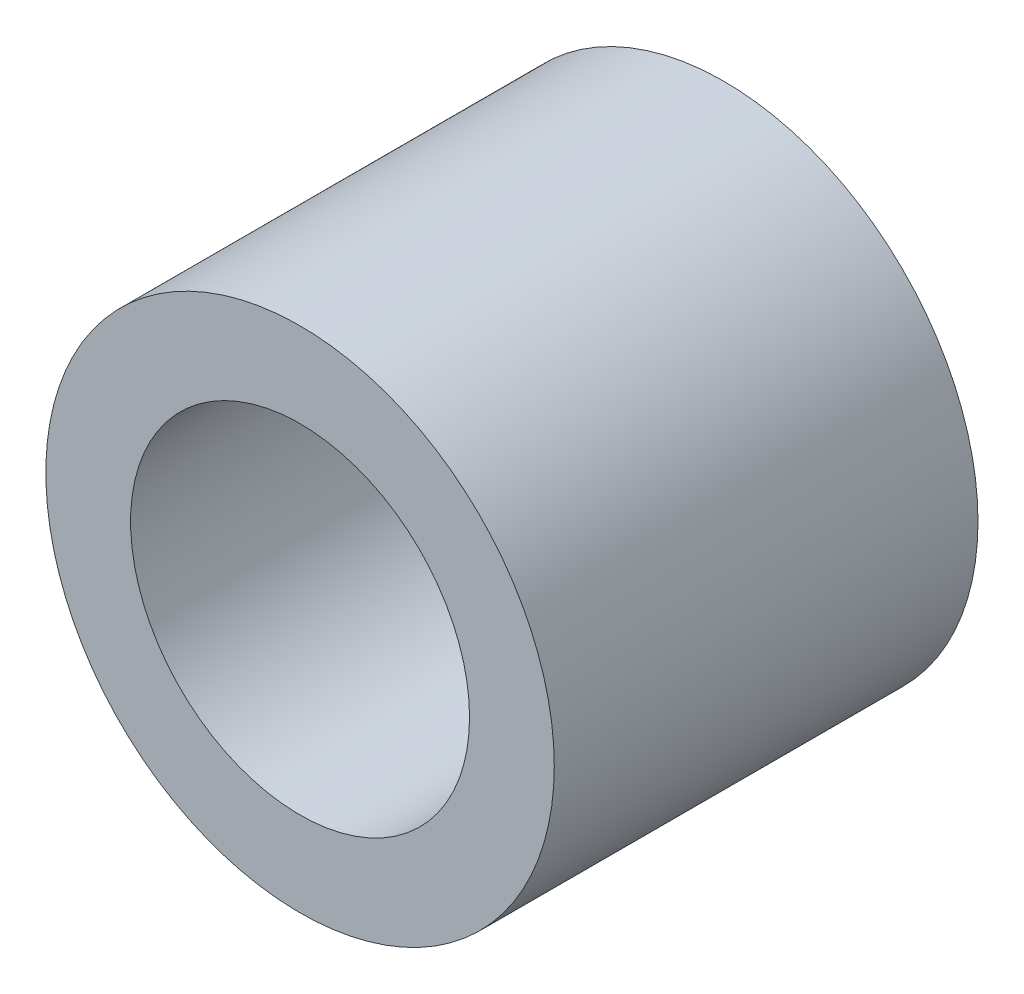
ISO-10303-21;
HEADER;
FILE_DESCRIPTION(('STEP AP214'),'2;1');
FILE_NAME('part.step','',(''),(''),'','','');
FILE_SCHEMA(('AUTOMOTIVE_DESIGN { 1 0 10303 214 1 1 1 1 }'));
ENDSEC;
DATA;
#1=APPLICATION_CONTEXT('core data for automotive mechanical design processes');
#2=APPLICATION_PROTOCOL_DEFINITION('international standard','automotive_design',2000,#1);
#3=PRODUCT_CONTEXT('',#1,'mechanical');
#4=PRODUCT('Part','Part','',(#3));
#5=PRODUCT_RELATED_PRODUCT_CATEGORY('part','',(#4));
#6=PRODUCT_DEFINITION_FORMATION('','',#4);
#7=PRODUCT_DEFINITION_CONTEXT('part definition',#1,'design');
#8=PRODUCT_DEFINITION('design','',#6,#7);
#9=PRODUCT_DEFINITION_SHAPE('','',#8);
#10=(LENGTH_UNIT() NAMED_UNIT(*) SI_UNIT(.MILLI.,.METRE.));
#11=(NAMED_UNIT(*) PLANE_ANGLE_UNIT() SI_UNIT($,.RADIAN.));
#12=(NAMED_UNIT(*) SI_UNIT($,.STERADIAN.) SOLID_ANGLE_UNIT());
#13=UNCERTAINTY_MEASURE_WITH_UNIT(LENGTH_MEASURE(1.E-05),#10,'distance_accuracy_value','');
#14=(GEOMETRIC_REPRESENTATION_CONTEXT(3) GLOBAL_UNCERTAINTY_ASSIGNED_CONTEXT((#13)) GLOBAL_UNIT_ASSIGNED_CONTEXT((#10,
#11,#12)) REPRESENTATION_CONTEXT('',''));
#15=CARTESIAN_POINT('',(0.,0.,0.));
#16=DIRECTION('',(0.,0.,1.));
#17=DIRECTION('',(1.,0.,0.));
#18=AXIS2_PLACEMENT_3D('',#15,#16,#17);
#19=CARTESIAN_POINT('',(0.,0.,25.));
#20=DIRECTION('',(0.,0.,1.));
#21=DIRECTION('',(1.,0.,0.));
#22=AXIS2_PLACEMENT_3D('',#19,#20,#21);
#23=PLANE('',#22);
#24=CARTESIAN_POINT('',(0.,0.,25.));
#25=DIRECTION('',(0.,0.,1.));
#26=DIRECTION('',(1.,0.,0.));
#27=AXIS2_PLACEMENT_3D('',#24,#25,#26);
#28=CIRCLE('',#27,15.);
#29=CARTESIAN_POINT('',(15.,0.,25.));
#30=VERTEX_POINT('',#29);
#31=EDGE_CURVE('E10',#30,#30,#28,.T.);
#32=ORIENTED_EDGE('',*,*,#31,.T.);
#33=EDGE_LOOP('',(#32));
#34=FACE_BOUND('',#33,.T.);
#35=CARTESIAN_POINT('',(0.,0.,25.));
#36=DIRECTION('',(0.,0.,1.));
#37=DIRECTION('',(1.,0.,0.));
#38=AXIS2_PLACEMENT_3D('',#35,#36,#37);
#39=CIRCLE('',#38,10.);
#40=CARTESIAN_POINT('',(10.,0.,25.));
#41=VERTEX_POINT('',#40);
#42=EDGE_CURVE('E41',#41,#41,#39,.T.);
#43=ORIENTED_EDGE('',*,*,#42,.F.);
#44=EDGE_LOOP('',(#43));
#45=FACE_BOUND('',#44,.T.);
#46=ADVANCED_FACE('F30',(#34,#45),#23,.T.);
#47=CARTESIAN_POINT('',(0.,0.,0.));
#48=DIRECTION('',(0.,0.,1.));
#49=DIRECTION('',(1.,0.,0.));
#50=AXIS2_PLACEMENT_3D('',#47,#48,#49);
#51=PLANE('',#50);
#52=CARTESIAN_POINT('',(0.,0.,0.));
#53=DIRECTION('',(0.,0.,1.));
#54=DIRECTION('',(1.,0.,0.));
#55=AXIS2_PLACEMENT_3D('',#52,#53,#54);
#56=CIRCLE('',#55,15.);
#57=CARTESIAN_POINT('',(15.,0.,0.));
#58=VERTEX_POINT('',#57);
#59=EDGE_CURVE('E34',#58,#58,#56,.T.);
#60=ORIENTED_EDGE('',*,*,#59,.F.);
#61=EDGE_LOOP('',(#60));
#62=FACE_BOUND('',#61,.T.);
#63=CARTESIAN_POINT('',(0.,0.,0.));
#64=DIRECTION('',(0.,0.,1.));
#65=DIRECTION('',(1.,0.,0.));
#66=AXIS2_PLACEMENT_3D('',#63,#64,#65);
#67=CIRCLE('',#66,10.);
#68=CARTESIAN_POINT('',(10.,0.,0.));
#69=VERTEX_POINT('',#68);
#70=EDGE_CURVE('E43',#69,#69,#67,.T.);
#71=ORIENTED_EDGE('',*,*,#70,.T.);
#72=EDGE_LOOP('',(#71));
#73=FACE_BOUND('',#72,.T.);
#74=ADVANCED_FACE('F53',(#62,#73),#51,.F.);
#75=CARTESIAN_POINT('',(0.,0.,25.));
#76=DIRECTION('',(0.,0.,-1.));
#77=DIRECTION('',(-1.,0.,0.));
#78=AXIS2_PLACEMENT_3D('',#75,#76,#77);
#79=CYLINDRICAL_SURFACE('',#78,15.);
#80=ORIENTED_EDGE('',*,*,#31,.F.);
#81=EDGE_LOOP('',(#80));
#82=FACE_BOUND('',#81,.T.);
#83=ORIENTED_EDGE('',*,*,#59,.T.);
#84=EDGE_LOOP('',(#83));
#85=FACE_BOUND('',#84,.T.);
#86=ADVANCED_FACE('F32',(#82,#85),#79,.T.);
#87=CARTESIAN_POINT('',(0.,0.,25.));
#88=DIRECTION('',(0.,0.,-1.));
#89=DIRECTION('',(-1.,0.,0.));
#90=AXIS2_PLACEMENT_3D('',#87,#88,#89);
#91=CYLINDRICAL_SURFACE('',#90,10.);
#92=ORIENTED_EDGE('',*,*,#42,.T.);
#93=EDGE_LOOP('',(#92));
#94=FACE_BOUND('',#93,.T.);
#95=ORIENTED_EDGE('',*,*,#70,.F.);
#96=EDGE_LOOP('',(#95));
#97=FACE_BOUND('',#96,.T.);
#98=ADVANCED_FACE('F49',(#94,#97),#91,.F.);
#99=CLOSED_SHELL('',(#46,#74,#86,#98));
#100=MANIFOLD_SOLID_BREP('B2',#99);
#101=ADVANCED_BREP_SHAPE_REPRESENTATION('',(#18,#100),#14);
#102=SHAPE_DEFINITION_REPRESENTATION(#9,#101);
ENDSEC;
END-ISO-10303-21;
